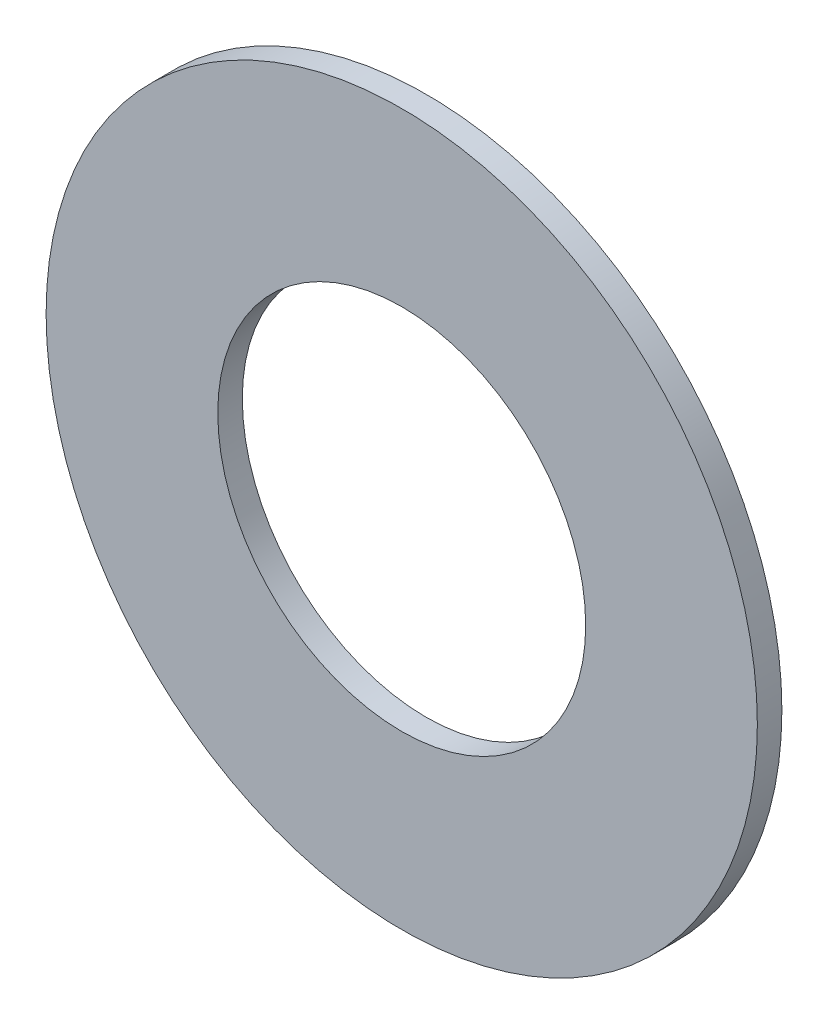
ISO-10303-21;
HEADER;
FILE_DESCRIPTION(('STEP AP214'),'2;1');
FILE_NAME('part.step','',(''),(''),'','','');
FILE_SCHEMA(('AUTOMOTIVE_DESIGN { 1 0 10303 214 1 1 1 1 }'));
ENDSEC;
DATA;
#1=APPLICATION_CONTEXT('core data for automotive mechanical design processes');
#2=APPLICATION_PROTOCOL_DEFINITION('international standard','automotive_design',2000,#1);
#3=PRODUCT_CONTEXT('',#1,'mechanical');
#4=PRODUCT('Part','Part','',(#3));
#5=PRODUCT_RELATED_PRODUCT_CATEGORY('part','',(#4));
#6=PRODUCT_DEFINITION_FORMATION('','',#4);
#7=PRODUCT_DEFINITION_CONTEXT('part definition',#1,'design');
#8=PRODUCT_DEFINITION('design','',#6,#7);
#9=PRODUCT_DEFINITION_SHAPE('','',#8);
#10=(LENGTH_UNIT() NAMED_UNIT(*) SI_UNIT(.MILLI.,.METRE.));
#11=(NAMED_UNIT(*) PLANE_ANGLE_UNIT() SI_UNIT($,.RADIAN.));
#12=(NAMED_UNIT(*) SI_UNIT($,.STERADIAN.) SOLID_ANGLE_UNIT());
#13=UNCERTAINTY_MEASURE_WITH_UNIT(LENGTH_MEASURE(1.E-05),#10,'distance_accuracy_value','');
#14=(GEOMETRIC_REPRESENTATION_CONTEXT(3) GLOBAL_UNCERTAINTY_ASSIGNED_CONTEXT((#13)) GLOBAL_UNIT_ASSIGNED_CONTEXT((#10,
#11,#12)) REPRESENTATION_CONTEXT('',''));
#15=CARTESIAN_POINT('',(0.,0.,0.));
#16=DIRECTION('',(0.,0.,1.));
#17=DIRECTION('',(1.,0.,0.));
#18=AXIS2_PLACEMENT_3D('',#15,#16,#17);
#19=CARTESIAN_POINT('',(0.,0.,1.5875));
#20=DIRECTION('',(0.,0.,1.));
#21=DIRECTION('',(1.,0.,0.));
#22=AXIS2_PLACEMENT_3D('',#19,#20,#21);
#23=PLANE('',#22);
#24=CARTESIAN_POINT('',(0.,0.,1.5875));
#25=DIRECTION('',(0.,0.,1.));
#26=DIRECTION('',(1.,0.,0.));
#27=AXIS2_PLACEMENT_3D('',#24,#25,#26);
#28=CIRCLE('',#27,46.032669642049);
#29=CARTESIAN_POINT('',(46.032669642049,0.,1.5875));
#30=VERTEX_POINT('',#29);
#31=EDGE_CURVE('E10',#30,#30,#28,.T.);
#32=ORIENTED_EDGE('',*,*,#31,.T.);
#33=EDGE_LOOP('',(#32));
#34=FACE_BOUND('',#33,.T.);
#35=CARTESIAN_POINT('',(0.,0.,1.5875));
#36=DIRECTION('',(0.,0.,1.));
#37=DIRECTION('',(1.,0.,0.));
#38=AXIS2_PLACEMENT_3D('',#35,#36,#37);
#39=CIRCLE('',#38,23.8125);
#40=CARTESIAN_POINT('',(23.8125,0.,1.5875));
#41=VERTEX_POINT('',#40);
#42=EDGE_CURVE('E55',#41,#41,#39,.T.);
#43=ORIENTED_EDGE('',*,*,#42,.F.);
#44=EDGE_LOOP('',(#43));
#45=FACE_BOUND('',#44,.T.);
#46=ADVANCED_FACE('F41',(#34,#45),#23,.T.);
#47=CARTESIAN_POINT('',(0.,0.,-1.5875));
#48=DIRECTION('',(0.,0.,1.));
#49=DIRECTION('',(1.,0.,0.));
#50=AXIS2_PLACEMENT_3D('',#47,#48,#49);
#51=PLANE('',#50);
#52=CARTESIAN_POINT('',(0.,0.,-1.5875));
#53=DIRECTION('',(0.,0.,1.));
#54=DIRECTION('',(1.,0.,0.));
#55=AXIS2_PLACEMENT_3D('',#52,#53,#54);
#56=CIRCLE('',#55,46.032669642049);
#57=CARTESIAN_POINT('',(46.032669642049,0.,-1.5875));
#58=VERTEX_POINT('',#57);
#59=EDGE_CURVE('E44',#58,#58,#56,.T.);
#60=ORIENTED_EDGE('',*,*,#59,.F.);
#61=EDGE_LOOP('',(#60));
#62=FACE_BOUND('',#61,.T.);
#63=CARTESIAN_POINT('',(0.,0.,-1.5875));
#64=DIRECTION('',(0.,0.,1.));
#65=DIRECTION('',(1.,0.,0.));
#66=AXIS2_PLACEMENT_3D('',#63,#64,#65);
#67=CIRCLE('',#66,23.8125);
#68=CARTESIAN_POINT('',(23.8125,0.,-1.5875));
#69=VERTEX_POINT('',#68);
#70=EDGE_CURVE('E53',#69,#69,#67,.T.);
#71=ORIENTED_EDGE('',*,*,#70,.T.);
#72=EDGE_LOOP('',(#71));
#73=FACE_BOUND('',#72,.T.);
#74=ADVANCED_FACE('F63',(#62,#73),#51,.F.);
#75=CARTESIAN_POINT('',(0.,0.,1.5875));
#76=DIRECTION('',(0.,0.,-1.));
#77=DIRECTION('',(-1.,0.,0.));
#78=AXIS2_PLACEMENT_3D('',#75,#76,#77);
#79=CYLINDRICAL_SURFACE('',#78,46.032669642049);
#80=ORIENTED_EDGE('',*,*,#31,.F.);
#81=EDGE_LOOP('',(#80));
#82=FACE_BOUND('',#81,.T.);
#83=ORIENTED_EDGE('',*,*,#59,.T.);
#84=EDGE_LOOP('',(#83));
#85=FACE_BOUND('',#84,.T.);
#86=ADVANCED_FACE('F43',(#82,#85),#79,.T.);
#87=CARTESIAN_POINT('',(0.,0.,1.5875));
#88=DIRECTION('',(0.,0.,-1.));
#89=DIRECTION('',(-1.,0.,0.));
#90=AXIS2_PLACEMENT_3D('',#87,#88,#89);
#91=CYLINDRICAL_SURFACE('',#90,23.8125);
#92=ORIENTED_EDGE('',*,*,#42,.T.);
#93=EDGE_LOOP('',(#92));
#94=FACE_BOUND('',#93,.T.);
#95=ORIENTED_EDGE('',*,*,#70,.F.);
#96=EDGE_LOOP('',(#95));
#97=FACE_BOUND('',#96,.T.);
#98=ADVANCED_FACE('F58',(#94,#97),#91,.F.);
#99=CLOSED_SHELL('',(#46,#74,#86,#98));
#100=MANIFOLD_SOLID_BREP('B2',#99);
#101=ADVANCED_BREP_SHAPE_REPRESENTATION('',(#18,#100),#14);
#102=SHAPE_DEFINITION_REPRESENTATION(#9,#101);
ENDSEC;
END-ISO-10303-21;
